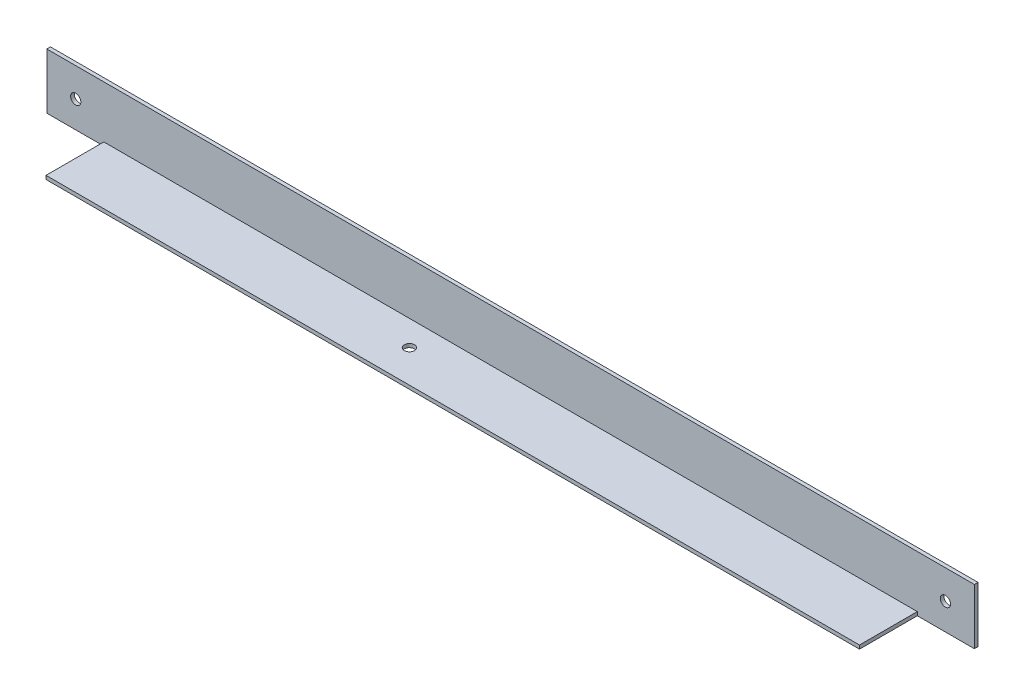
from build123d import *

# Parameters (mm, degrees)
SKETCH1_W           = 406.4
SKETCH1_H           = 24.384
BOSS_EXTRUDE1_DEPTH = 26.924
SKETCH2_W           = 406.4
SKETCH2_H           = 25.3365
CUT_EXTRUDE1_DEPTH  = 12.7
SKETCH3_W           = 406.4
SKETCH3_H           = 10.0965
CUT_EXTRUDE3_DEPTH  = 25.3365
SKETCH4_R           = 2.032
CUT_EXTRUDE4_DEPTH  = 2.54
SKETCH5_R           = 2.235
CUT_EXTRUDE5_DEPTH  = 2.54
SKETCH6_W           = 25
SKETCH6_H           = 25.3365
CUT_EXTRUDE6_DEPTH  = 2.54
SKETCH7_R           = 2.23393
CUT_EXTRUDE7_DEPTH  = 10


with BuildPart() as part:
    # Sketch1 → Boss-Extrude1 (new body)
    with BuildSketch(Plane.XY):
        with Locations((-6.626086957, 55.646509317)):
            Rectangle(SKETCH1_W, SKETCH1_H)
    extrude(amount=BOSS_EXTRUDE1_DEPTH)

    # Sketch2 → Cut-Extrude1 (cut)
    with BuildSketch(Plane(origin=(0, 67.838509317, 0), x_dir=(1, 0, 0), z_dir=(0, 1, 0))):
        with Locations((-6.626086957, -14.25575)):
            Rectangle(SKETCH2_W, SKETCH2_H)
    extrude(amount=-CUT_EXTRUDE1_DEPTH, mode=Mode.SUBTRACT)

    # Sketch3 → Cut-Extrude3 (cut)
    with BuildSketch(Plane.XY.offset(26.924)):
        with Locations((-6.626086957, 50.090259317)):
            Rectangle(SKETCH3_W, SKETCH3_H)
    extrude(amount=-CUT_EXTRUDE3_DEPTH, mode=Mode.SUBTRACT)

    # Sketch4 → Cut-Extrude4 (cut)
    with BuildSketch(Plane.XZ.offset(-43.454509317)):
        with Locations(Location((-197.126086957, 12.7, 0), (0, 0, 270))):
            Circle(SKETCH4_R)
        with Locations(Location((183.873913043, 12.7, 0), (0, 0, 270))):
            Circle(SKETCH4_R)
    extrude(amount=-CUT_EXTRUDE4_DEPTH, mode=Mode.SUBTRACT)

    # Sketch5 → Cut-Extrude5 (cut)
    with BuildSketch(Plane(origin=(0, 0, 0), x_dir=(-1, 0, 0), z_dir=(0, 0, -1))):
        with Locations((-183.873913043, 55.138509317)):
            Circle(SKETCH5_R)
        with Locations((197.126086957, 55.138509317)):
            Circle(SKETCH5_R)
    extrude(amount=-CUT_EXTRUDE5_DEPTH, mode=Mode.SUBTRACT)

    # Sketch6 → Cut-Extrude6 (cut)
    with BuildSketch(Plane(origin=(0, 45.042009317, 0), x_dir=(1, 0, 0), z_dir=(0, 1, 0))):
        with Locations((-197.326086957, -14.25575)):
            Rectangle(SKETCH6_W, SKETCH6_H)
        with Locations((184.073913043, -14.25575)):
            Rectangle(SKETCH6_W, SKETCH6_H)
    extrude(amount=-CUT_EXTRUDE6_DEPTH, mode=Mode.SUBTRACT)

    # Sketch7 → Cut-Extrude7 (cut)
    with BuildSketch(Plane.XZ.offset(-43.454509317)):
        with Locations(Location((-39.826086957, 12.7, 0), (0, 0, 270))):
            Circle(SKETCH7_R)
    extrude(amount=-CUT_EXTRUDE7_DEPTH, mode=Mode.SUBTRACT)


solid = part.part
